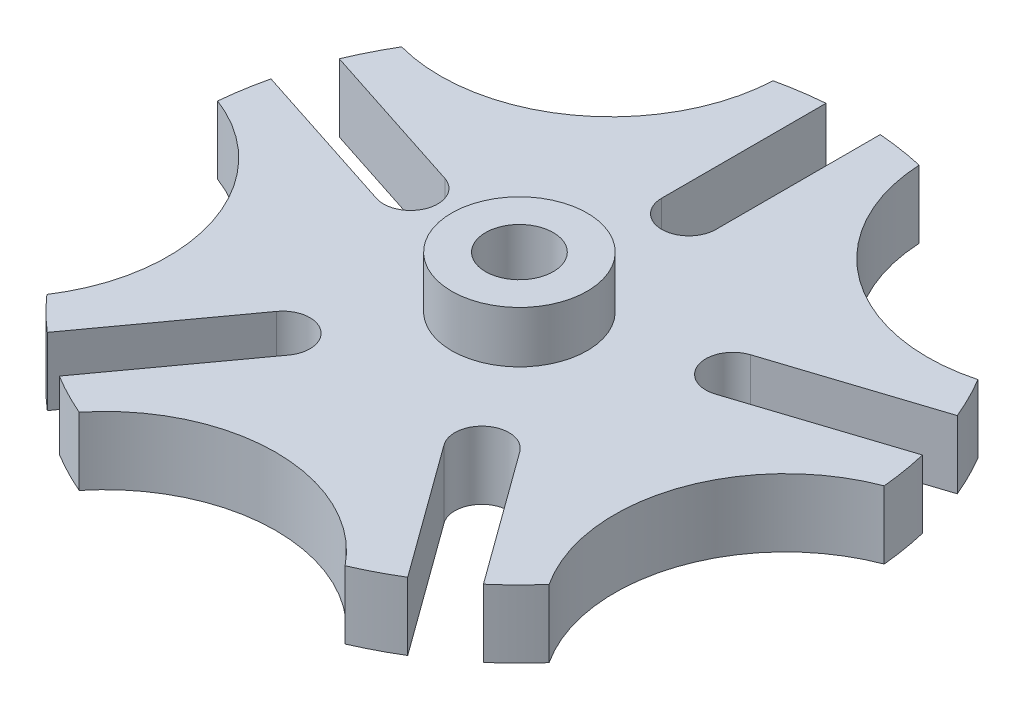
from build123d import *

# Parameters (mm, degrees)
SKETCH1_R          = 31.369
EXTRUDE1_DEPTH     = 3.175
CUT_EXTRUDE1_DEPTH = 6.35
CIRPATTERN1_COUNT  = 5
CUT_EXTRUDE2_DEPTH = 45.814627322
CIRPATTERN2_COUNT  = 5
SKETCH4_R          = 6.35
SKETCH4_R_2        = 3.175
EXTRUDE2_DEPTH     = 4.826
SKETCH5_R          = 3.175
CUT_EXTRUDE3_DEPTH = 45.64496885


with BuildPart() as part:
    # Sketch1 → Extrude1 (new, symmetric)
    with BuildSketch(Plane(origin=(0, 0, 0), x_dir=(1, 0, 0), z_dir=(0, 1, 0))):
        with Locations(Location((0, 0, 0), (0, 0, 270))):
            Circle(SKETCH1_R)
    extrude(amount=EXTRUDE1_DEPTH, both=True)

    # Sketch2 → Cut-Extrude1 (cut)
    with BuildSketch(Plane(origin=(0, 3.175, 0), x_dir=(-1, 0, 0), z_dir=(0, 1, 0))):
        with BuildLine():
            Line((-2.54, -15.875), (-2.54, -31.265996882))
            ThreePointArc((-2.54, -31.265996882), (0, -31.369), (2.54, -31.265996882))
            Line((2.54, -31.265996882), (2.54, -15.875))
            ThreePointArc((2.54, -15.875), (0, -13.335), (-2.54, -15.875))
        make_face()
    cut_extrude1 = extrude(amount=-CUT_EXTRUDE1_DEPTH, mode=Mode.SUBTRACT)

    # CirPattern1: Cut-Extrude1 ×5 about axis
    cirpattern1_axis = Axis((0, 0, 0), (0, 1, 0))
    for i in range(1, CIRPATTERN1_COUNT):
        add(cut_extrude1.rotate(cirpattern1_axis, i * 360 / CIRPATTERN1_COUNT), mode=Mode.SUBTRACT)

    # Sketch3 → Cut-Extrude2 (cut, through all)
    with BuildSketch(Plane(origin=(0, 3.175, 0), x_dir=(-1, 0, 0), z_dir=(0, 1, 0))):
        with BuildLine():
            ThreePointArc((-6.841079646, -30.613947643), (-13.417362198, -18.46741475), (-27.001584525, -15.966483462))
            ThreePointArc((-27.001584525, -15.966483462), (-18.438235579, -25.378054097), (-6.841079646, -30.613947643))
        make_face()
    cut_extrude2 = extrude(amount=-CUT_EXTRUDE2_DEPTH, mode=Mode.SUBTRACT)

    # CirPattern2: Cut-Extrude2 ×5 about axis
    cirpattern2_axis = Axis((0, 0, 0), (0, 1, 0))
    for i in range(1, CIRPATTERN2_COUNT):
        add(cut_extrude2.rotate(cirpattern2_axis, i * 360 / CIRPATTERN2_COUNT), mode=Mode.SUBTRACT)

    # Sketch4 → Extrude2 (add)
    with BuildSketch(Plane(origin=(0, 3.175, 0), x_dir=(-1, 0, 0), z_dir=(0, 1, 0))):
        with Locations(Location((0, 0, 0), (0, 0, 90))):
            Circle(SKETCH4_R)
        with Locations(Location((0, 0, 0), (0, 0, 90))):
            Circle(SKETCH4_R_2, mode=Mode.SUBTRACT)
    extrude(amount=EXTRUDE2_DEPTH)

    # Sketch5 → Cut-Extrude3 (cut, through all)
    with BuildSketch(Plane(origin=(0, 3.175, 0), x_dir=(-1, 0, 0), z_dir=(0, 1, 0))):
        with Locations(Location((0, 0, 0), (0, 0, 90))):
            Circle(SKETCH5_R)
    extrude(amount=-CUT_EXTRUDE3_DEPTH, mode=Mode.SUBTRACT)


solid = part.part
